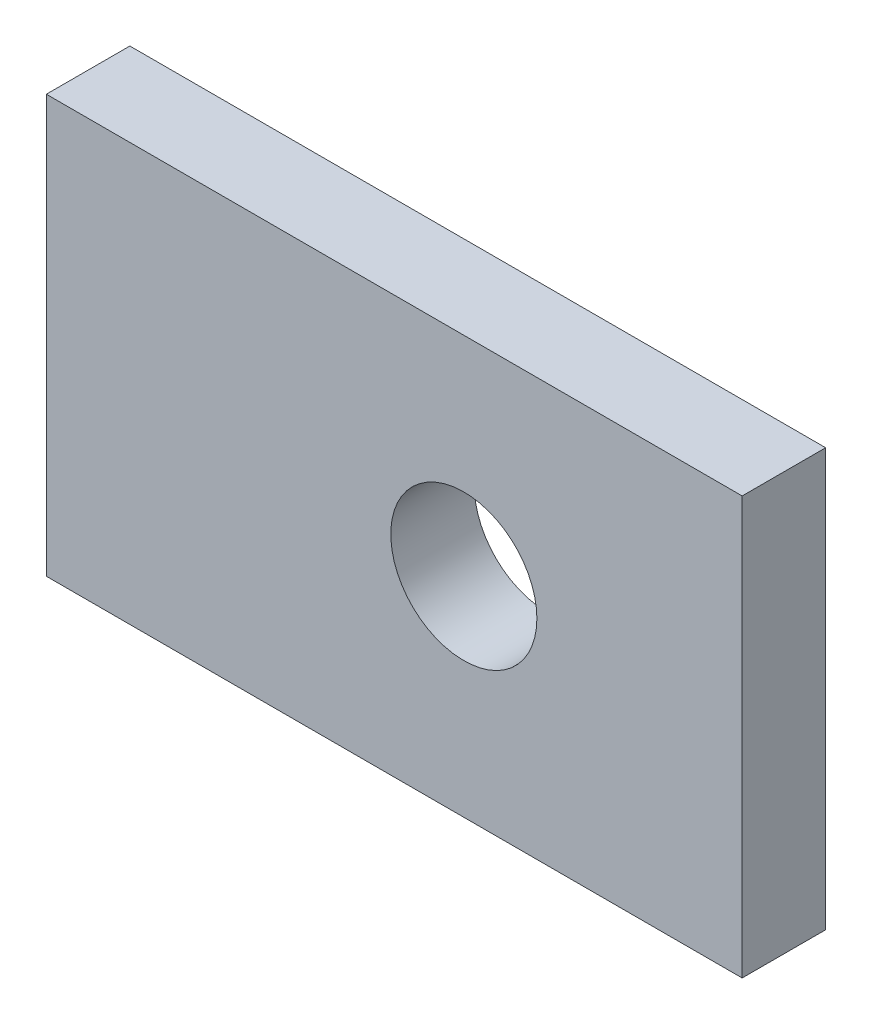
ISO-10303-21;
HEADER;
FILE_DESCRIPTION(('STEP AP214'),'2;1');
FILE_NAME('part.step','',(''),(''),'','','');
FILE_SCHEMA(('AUTOMOTIVE_DESIGN { 1 0 10303 214 1 1 1 1 }'));
ENDSEC;
DATA;
#1=APPLICATION_CONTEXT('core data for automotive mechanical design processes');
#2=APPLICATION_PROTOCOL_DEFINITION('international standard','automotive_design',2000,#1);
#3=PRODUCT_CONTEXT('',#1,'mechanical');
#4=PRODUCT('Part','Part','',(#3));
#5=PRODUCT_RELATED_PRODUCT_CATEGORY('part','',(#4));
#6=PRODUCT_DEFINITION_FORMATION('','',#4);
#7=PRODUCT_DEFINITION_CONTEXT('part definition',#1,'design');
#8=PRODUCT_DEFINITION('design','',#6,#7);
#9=PRODUCT_DEFINITION_SHAPE('','',#8);
#10=(LENGTH_UNIT() NAMED_UNIT(*) SI_UNIT(.MILLI.,.METRE.));
#11=(NAMED_UNIT(*) PLANE_ANGLE_UNIT() SI_UNIT($,.RADIAN.));
#12=(NAMED_UNIT(*) SI_UNIT($,.STERADIAN.) SOLID_ANGLE_UNIT());
#13=UNCERTAINTY_MEASURE_WITH_UNIT(LENGTH_MEASURE(1.E-05),#10,'distance_accuracy_value','');
#14=(GEOMETRIC_REPRESENTATION_CONTEXT(3) GLOBAL_UNCERTAINTY_ASSIGNED_CONTEXT((#13)) GLOBAL_UNIT_ASSIGNED_CONTEXT((#10,
#11,#12)) REPRESENTATION_CONTEXT('',''));
#15=CARTESIAN_POINT('',(0.,0.,0.));
#16=DIRECTION('',(0.,0.,1.));
#17=DIRECTION('',(1.,0.,0.));
#18=AXIS2_PLACEMENT_3D('',#15,#16,#17);
#19=CARTESIAN_POINT('',(0.,60.,12.));
#20=DIRECTION('',(0.,0.,-1.));
#21=DIRECTION('',(-1.,0.,0.));
#22=AXIS2_PLACEMENT_3D('',#19,#20,#21);
#23=PLANE('',#22);
#24=DIRECTION('',(0.,-1.,0.));
#25=VECTOR('',#24,1.);
#26=CARTESIAN_POINT('',(0.,0.,12.));
#27=LINE('',#26,#25);
#28=CARTESIAN_POINT('',(0.,60.,12.));
#29=VERTEX_POINT('',#28);
#30=CARTESIAN_POINT('',(0.,0.,12.));
#31=VERTEX_POINT('',#30);
#32=EDGE_CURVE('E165',#29,#31,#27,.T.);
#33=ORIENTED_EDGE('',*,*,#32,.T.);
#34=DIRECTION('',(1.,0.,0.));
#35=VECTOR('',#34,1.);
#36=CARTESIAN_POINT('',(0.,0.,12.));
#37=LINE('',#36,#35);
#38=CARTESIAN_POINT('',(100.,0.,12.));
#39=VERTEX_POINT('',#38);
#40=EDGE_CURVE('E163',#31,#39,#37,.T.);
#41=ORIENTED_EDGE('',*,*,#40,.T.);
#42=DIRECTION('',(0.,1.,0.));
#43=VECTOR('',#42,1.);
#44=CARTESIAN_POINT('',(100.,0.,12.));
#45=LINE('',#44,#43);
#46=CARTESIAN_POINT('',(100.,60.,12.));
#47=VERTEX_POINT('',#46);
#48=EDGE_CURVE('E161',#39,#47,#45,.T.);
#49=ORIENTED_EDGE('',*,*,#48,.T.);
#50=DIRECTION('',(-1.,0.,0.));
#51=VECTOR('',#50,1.);
#52=CARTESIAN_POINT('',(0.,60.,12.));
#53=LINE('',#52,#51);
#54=EDGE_CURVE('E159',#47,#29,#53,.T.);
#55=ORIENTED_EDGE('',*,*,#54,.T.);
#56=EDGE_LOOP('',(#33,#41,#49,#55));
#57=FACE_BOUND('',#56,.T.);
#58=CARTESIAN_POINT('',(60.,30.,12.));
#59=DIRECTION('',(0.,0.,1.));
#60=DIRECTION('',(1.,0.,0.));
#61=AXIS2_PLACEMENT_3D('',#58,#59,#60);
#62=CIRCLE('',#61,10.5);
#63=CARTESIAN_POINT('',(70.5,30.,12.));
#64=VERTEX_POINT('',#63);
#65=EDGE_CURVE('E139',#64,#64,#62,.T.);
#66=ORIENTED_EDGE('',*,*,#65,.F.);
#67=EDGE_LOOP('',(#66));
#68=FACE_BOUND('',#67,.T.);
#69=ADVANCED_FACE('F31',(#57,#68),#23,.F.);
#70=CARTESIAN_POINT('',(0.,60.,0.));
#71=DIRECTION('',(0.,0.,-1.));
#72=DIRECTION('',(-1.,0.,0.));
#73=AXIS2_PLACEMENT_3D('',#70,#71,#72);
#74=PLANE('',#73);
#75=DIRECTION('',(0.,1.,0.));
#76=VECTOR('',#75,1.);
#77=CARTESIAN_POINT('',(26.,37.5,0.));
#78=LINE('',#77,#76);
#79=CARTESIAN_POINT('',(26.,22.5,0.));
#80=VERTEX_POINT('',#79);
#81=CARTESIAN_POINT('',(26.,37.5,0.));
#82=VERTEX_POINT('',#81);
#83=EDGE_CURVE('E150',#80,#82,#78,.T.);
#84=ORIENTED_EDGE('',*,*,#83,.T.);
#85=DIRECTION('',(-1.,0.,0.));
#86=VECTOR('',#85,1.);
#87=CARTESIAN_POINT('',(20.,37.5,0.));
#88=LINE('',#87,#86);
#89=CARTESIAN_POINT('',(0.,37.5,0.));
#90=VERTEX_POINT('',#89);
#91=EDGE_CURVE('E107',#82,#90,#88,.T.);
#92=ORIENTED_EDGE('',*,*,#91,.T.);
#93=DIRECTION('',(0.,-1.,0.));
#94=VECTOR('',#93,1.);
#95=CARTESIAN_POINT('',(0.,0.,0.));
#96=LINE('',#95,#94);
#97=CARTESIAN_POINT('',(0.,60.,0.));
#98=VERTEX_POINT('',#97);
#99=EDGE_CURVE('E119',#98,#90,#96,.T.);
#100=ORIENTED_EDGE('',*,*,#99,.F.);
#101=DIRECTION('',(-1.,0.,0.));
#102=VECTOR('',#101,1.);
#103=CARTESIAN_POINT('',(0.,60.,0.));
#104=LINE('',#103,#102);
#105=CARTESIAN_POINT('',(100.,60.,0.));
#106=VERTEX_POINT('',#105);
#107=EDGE_CURVE('E168',#106,#98,#104,.T.);
#108=ORIENTED_EDGE('',*,*,#107,.F.);
#109=DIRECTION('',(0.,1.,0.));
#110=VECTOR('',#109,1.);
#111=CARTESIAN_POINT('',(100.,0.,0.));
#112=LINE('',#111,#110);
#113=CARTESIAN_POINT('',(100.,0.,0.));
#114=VERTEX_POINT('',#113);
#115=EDGE_CURVE('E169',#114,#106,#112,.T.);
#116=ORIENTED_EDGE('',*,*,#115,.F.);
#117=DIRECTION('',(1.,0.,0.));
#118=VECTOR('',#117,1.);
#119=CARTESIAN_POINT('',(0.,0.,0.));
#120=LINE('',#119,#118);
#121=CARTESIAN_POINT('',(0.,0.,0.));
#122=VERTEX_POINT('',#121);
#123=EDGE_CURVE('E143',#122,#114,#120,.T.);
#124=ORIENTED_EDGE('',*,*,#123,.F.);
#125=CARTESIAN_POINT('',(0.,22.5,0.));
#126=VERTEX_POINT('',#125);
#127=EDGE_CURVE('E123',#126,#122,#96,.T.);
#128=ORIENTED_EDGE('',*,*,#127,.F.);
#129=DIRECTION('',(-1.,0.,0.));
#130=VECTOR('',#129,1.);
#131=CARTESIAN_POINT('',(20.,22.5,0.));
#132=LINE('',#131,#130);
#133=EDGE_CURVE('E131',#80,#126,#132,.T.);
#134=ORIENTED_EDGE('',*,*,#133,.F.);
#135=EDGE_LOOP('',(#84,#92,#100,#108,#116,#124,#128,#134));
#136=FACE_BOUND('',#135,.T.);
#137=CARTESIAN_POINT('',(60.,30.,0.));
#138=DIRECTION('',(0.,0.,1.));
#139=DIRECTION('',(1.,0.,0.));
#140=AXIS2_PLACEMENT_3D('',#137,#138,#139);
#141=CIRCLE('',#140,10.5);
#142=CARTESIAN_POINT('',(70.5,30.,0.));
#143=VERTEX_POINT('',#142);
#144=EDGE_CURVE('E136',#143,#143,#141,.T.);
#145=ORIENTED_EDGE('',*,*,#144,.T.);
#146=EDGE_LOOP('',(#145));
#147=FACE_BOUND('',#146,.T.);
#148=ADVANCED_FACE('F184',(#136,#147),#74,.T.);
#149=CARTESIAN_POINT('',(0.,0.,12.));
#150=DIRECTION('',(1.,0.,0.));
#151=DIRECTION('',(0.,0.,-1.));
#152=AXIS2_PLACEMENT_3D('',#149,#150,#151);
#153=PLANE('',#152);
#154=ORIENTED_EDGE('',*,*,#99,.T.);
#155=DIRECTION('',(0.,-0.6,-0.8));
#156=VECTOR('',#155,1.);
#157=CARTESIAN_POINT('',(0.,37.5,0.));
#158=LINE('',#157,#156);
#159=CARTESIAN_POINT('',(0.,33.2,-5.7333333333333));
#160=VERTEX_POINT('',#159);
#161=EDGE_CURVE('E102',#90,#160,#158,.T.);
#162=ORIENTED_EDGE('',*,*,#161,.T.);
#163=CARTESIAN_POINT('',(0.,30.,-3.33333333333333));
#164=DIRECTION('',(-1.,0.,0.));
#165=DIRECTION('',(0.,0.,-1.));
#166=AXIS2_PLACEMENT_3D('',#163,#164,#165);
#167=CIRCLE('',#166,4.);
#168=CARTESIAN_POINT('',(0.,26.8,-5.7333333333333));
#169=VERTEX_POINT('',#168);
#170=EDGE_CURVE('E110',#160,#169,#167,.T.);
#171=ORIENTED_EDGE('',*,*,#170,.T.);
#172=DIRECTION('',(0.,-0.6,0.8));
#173=VECTOR('',#172,1.);
#174=CARTESIAN_POINT('',(0.,26.8,-5.7333333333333));
#175=LINE('',#174,#173);
#176=EDGE_CURVE('E114',#169,#126,#175,.T.);
#177=ORIENTED_EDGE('',*,*,#176,.T.);
#178=ORIENTED_EDGE('',*,*,#127,.T.);
#179=DIRECTION('',(0.,0.,-1.));
#180=VECTOR('',#179,1.);
#181=CARTESIAN_POINT('',(0.,0.,12.));
#182=LINE('',#181,#180);
#183=EDGE_CURVE('E147',#31,#122,#182,.T.);
#184=ORIENTED_EDGE('',*,*,#183,.F.);
#185=ORIENTED_EDGE('',*,*,#32,.F.);
#186=DIRECTION('',(0.,0.,-1.));
#187=VECTOR('',#186,1.);
#188=CARTESIAN_POINT('',(0.,60.,12.));
#189=LINE('',#188,#187);
#190=EDGE_CURVE('E157',#29,#98,#189,.T.);
#191=ORIENTED_EDGE('',*,*,#190,.T.);
#192=EDGE_LOOP('',(#154,#162,#171,#177,#178,#184,#185,#191));
#193=FACE_BOUND('',#192,.T.);
#194=ADVANCED_FACE('F33',(#193),#153,.F.);
#195=CARTESIAN_POINT('',(0.,0.,12.));
#196=DIRECTION('',(0.,1.,0.));
#197=DIRECTION('',(0.,0.,1.));
#198=AXIS2_PLACEMENT_3D('',#195,#196,#197);
#199=PLANE('',#198);
#200=ORIENTED_EDGE('',*,*,#123,.T.);
#201=DIRECTION('',(0.,0.,-1.));
#202=VECTOR('',#201,1.);
#203=CARTESIAN_POINT('',(100.,0.,12.));
#204=LINE('',#203,#202);
#205=EDGE_CURVE('E151',#39,#114,#204,.T.);
#206=ORIENTED_EDGE('',*,*,#205,.F.);
#207=ORIENTED_EDGE('',*,*,#40,.F.);
#208=ORIENTED_EDGE('',*,*,#183,.T.);
#209=EDGE_LOOP('',(#200,#206,#207,#208));
#210=FACE_BOUND('',#209,.T.);
#211=ADVANCED_FACE('F176',(#210),#199,.F.);
#212=CARTESIAN_POINT('',(100.,0.,12.));
#213=DIRECTION('',(-1.,0.,0.));
#214=DIRECTION('',(0.,0.,1.));
#215=AXIS2_PLACEMENT_3D('',#212,#213,#214);
#216=PLANE('',#215);
#217=ORIENTED_EDGE('',*,*,#115,.T.);
#218=DIRECTION('',(0.,0.,-1.));
#219=VECTOR('',#218,1.);
#220=CARTESIAN_POINT('',(100.,60.,12.));
#221=LINE('',#220,#219);
#222=EDGE_CURVE('E154',#47,#106,#221,.T.);
#223=ORIENTED_EDGE('',*,*,#222,.F.);
#224=ORIENTED_EDGE('',*,*,#48,.F.);
#225=ORIENTED_EDGE('',*,*,#205,.T.);
#226=EDGE_LOOP('',(#217,#223,#224,#225));
#227=FACE_BOUND('',#226,.T.);
#228=ADVANCED_FACE('F181',(#227),#216,.F.);
#229=CARTESIAN_POINT('',(0.,60.,12.));
#230=DIRECTION('',(0.,-1.,0.));
#231=DIRECTION('',(0.,0.,-1.));
#232=AXIS2_PLACEMENT_3D('',#229,#230,#231);
#233=PLANE('',#232);
#234=ORIENTED_EDGE('',*,*,#107,.T.);
#235=ORIENTED_EDGE('',*,*,#190,.F.);
#236=ORIENTED_EDGE('',*,*,#54,.F.);
#237=ORIENTED_EDGE('',*,*,#222,.T.);
#238=EDGE_LOOP('',(#234,#235,#236,#237));
#239=FACE_BOUND('',#238,.T.);
#240=ADVANCED_FACE('F188',(#239),#233,.F.);
#241=CARTESIAN_POINT('',(60.,30.,12.));
#242=DIRECTION('',(0.,0.,-1.));
#243=DIRECTION('',(-1.,0.,0.));
#244=AXIS2_PLACEMENT_3D('',#241,#242,#243);
#245=CYLINDRICAL_SURFACE('',#244,10.5);
#246=ORIENTED_EDGE('',*,*,#65,.T.);
#247=EDGE_LOOP('',(#246));
#248=FACE_BOUND('',#247,.T.);
#249=ORIENTED_EDGE('',*,*,#144,.F.);
#250=EDGE_LOOP('',(#249));
#251=FACE_BOUND('',#250,.T.);
#252=ADVANCED_FACE('F197',(#248,#251),#245,.F.);
#253=CARTESIAN_POINT('',(20.,26.8,-5.7333333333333));
#254=DIRECTION('',(0.,-0.8,-0.6));
#255=DIRECTION('',(0.,0.6,-0.8));
#256=AXIS2_PLACEMENT_3D('',#253,#254,#255);
#257=PLANE('',#256);
#258=ORIENTED_EDGE('',*,*,#176,.F.);
#259=DIRECTION('',(-1.,0.,0.));
#260=VECTOR('',#259,1.);
#261=CARTESIAN_POINT('',(20.,26.8,-5.7333333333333));
#262=LINE('',#261,#260);
#263=CARTESIAN_POINT('',(20.2666666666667,26.8,-5.7333333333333));
#264=VERTEX_POINT('',#263);
#265=EDGE_CURVE('E45',#264,#169,#262,.T.);
#266=ORIENTED_EDGE('',*,*,#265,.F.);
#267=DIRECTION('',(-0.624695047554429,0.468521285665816,-0.624695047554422));
#268=VECTOR('',#267,1.);
#269=CARTESIAN_POINT('',(15.0243902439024,30.7317073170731,-10.9756097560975));
#270=LINE('',#269,#268);
#271=EDGE_CURVE('E11',#264,#80,#270,.F.);
#272=ORIENTED_EDGE('',*,*,#271,.T.);
#273=ORIENTED_EDGE('',*,*,#133,.T.);
#274=EDGE_LOOP('',(#258,#266,#272,#273));
#275=FACE_BOUND('',#274,.T.);
#276=ADVANCED_FACE('F200',(#275),#257,.T.);
#277=CARTESIAN_POINT('',(20.,30.,-3.33333333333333));
#278=DIRECTION('',(-1.,0.,0.));
#279=DIRECTION('',(0.,0.,1.));
#280=AXIS2_PLACEMENT_3D('',#277,#278,#279);
#281=CYLINDRICAL_SURFACE('',#280,4.);
#282=ORIENTED_EDGE('',*,*,#170,.F.);
#283=DIRECTION('',(-1.,0.,0.));
#284=VECTOR('',#283,1.);
#285=CARTESIAN_POINT('',(20.,33.2,-5.7333333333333));
#286=LINE('',#285,#284);
#287=CARTESIAN_POINT('',(20.2666666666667,33.2,-5.7333333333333));
#288=VERTEX_POINT('',#287);
#289=EDGE_CURVE('E53',#288,#160,#286,.T.);
#290=ORIENTED_EDGE('',*,*,#289,.F.);
#291=CARTESIAN_POINT('',(22.6666666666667,30.,-3.33333333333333));
#292=DIRECTION('',(0.707106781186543,0.,-0.707106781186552));
#293=DIRECTION('',(-0.707106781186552,0.,-0.707106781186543));
#294=AXIS2_PLACEMENT_3D('',#291,#292,#293);
#295=ELLIPSE('',#294,5.65685424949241,4.);
#296=CARTESIAN_POINT('',(20.,32.9814239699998,-5.99999999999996));
#297=VERTEX_POINT('',#296);
#298=EDGE_CURVE('E306',#288,#297,#295,.F.);
#299=ORIENTED_EDGE('',*,*,#298,.T.);
#300=CARTESIAN_POINT('',(20.,30.,-3.33333333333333));
#301=DIRECTION('',(-1.,0.,0.));
#302=DIRECTION('',(0.,0.,-1.));
#303=AXIS2_PLACEMENT_3D('',#300,#301,#302);
#304=CIRCLE('',#303,4.);
#305=CARTESIAN_POINT('',(20.,27.0185760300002,-5.99999999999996));
#306=VERTEX_POINT('',#305);
#307=EDGE_CURVE('E130',#297,#306,#304,.T.);
#308=ORIENTED_EDGE('',*,*,#307,.T.);
#309=CARTESIAN_POINT('',(22.6666666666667,30.,-3.33333333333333));
#310=DIRECTION('',(0.707106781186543,0.,-0.707106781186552));
#311=DIRECTION('',(-0.707106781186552,0.,-0.707106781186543));
#312=AXIS2_PLACEMENT_3D('',#309,#310,#311);
#313=ELLIPSE('',#312,5.65685424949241,4.);
#314=EDGE_CURVE('E39',#306,#264,#313,.F.);
#315=ORIENTED_EDGE('',*,*,#314,.T.);
#316=ORIENTED_EDGE('',*,*,#265,.T.);
#317=EDGE_LOOP('',(#282,#290,#299,#308,#315,#316));
#318=FACE_BOUND('',#317,.T.);
#319=ADVANCED_FACE('F111',(#318),#281,.T.);
#320=CARTESIAN_POINT('',(20.,37.5,0.));
#321=DIRECTION('',(0.,0.8,-0.6));
#322=DIRECTION('',(0.,0.6,0.8));
#323=AXIS2_PLACEMENT_3D('',#320,#321,#322);
#324=PLANE('',#323);
#325=ORIENTED_EDGE('',*,*,#161,.F.);
#326=ORIENTED_EDGE('',*,*,#91,.F.);
#327=DIRECTION('',(0.624695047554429,0.468521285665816,0.624695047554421));
#328=VECTOR('',#327,1.);
#329=CARTESIAN_POINT('',(32.5853658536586,42.4390243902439,6.58536585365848));
#330=LINE('',#329,#328);
#331=EDGE_CURVE('E105',#82,#288,#330,.F.);
#332=ORIENTED_EDGE('',*,*,#331,.T.);
#333=ORIENTED_EDGE('',*,*,#289,.T.);
#334=EDGE_LOOP('',(#325,#326,#332,#333));
#335=FACE_BOUND('',#334,.T.);
#336=ADVANCED_FACE('F100',(#335),#324,.T.);
#337=CARTESIAN_POINT('',(20.,30.,-3.33333333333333));
#338=DIRECTION('',(1.,0.,0.));
#339=DIRECTION('',(0.,0.,-1.));
#340=AXIS2_PLACEMENT_3D('',#337,#338,#339);
#341=PLANE('',#340);
#342=ORIENTED_EDGE('',*,*,#307,.F.);
#343=DIRECTION('',(0.,-1.,0.));
#344=VECTOR('',#343,1.);
#345=CARTESIAN_POINT('',(20.,22.5,-5.99999999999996));
#346=LINE('',#345,#344);
#347=EDGE_CURVE('E303',#297,#306,#346,.T.);
#348=ORIENTED_EDGE('',*,*,#347,.T.);
#349=EDGE_LOOP('',(#342,#348));
#350=FACE_BOUND('',#349,.T.);
#351=ADVANCED_FACE('F249',(#350),#341,.T.);
#352=CARTESIAN_POINT('',(26.,60.,0.));
#353=DIRECTION('',(0.707106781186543,0.,-0.707106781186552));
#354=DIRECTION('',(-0.707106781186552,0.,-0.707106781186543));
#355=AXIS2_PLACEMENT_3D('',#352,#353,#354);
#356=PLANE('',#355);
#357=ORIENTED_EDGE('',*,*,#314,.F.);
#358=ORIENTED_EDGE('',*,*,#347,.F.);
#359=ORIENTED_EDGE('',*,*,#298,.F.);
#360=ORIENTED_EDGE('',*,*,#331,.F.);
#361=ORIENTED_EDGE('',*,*,#83,.F.);
#362=ORIENTED_EDGE('',*,*,#271,.F.);
#363=EDGE_LOOP('',(#357,#358,#359,#360,#361,#362));
#364=FACE_BOUND('',#363,.T.);
#365=ADVANCED_FACE('F255',(#364),#356,.T.);
#366=CLOSED_SHELL('',(#69,#148,#194,#211,#228,#240,#252,#276,#319,#336,#351,#365));
#367=MANIFOLD_SOLID_BREP('B2',#366);
#368=ADVANCED_BREP_SHAPE_REPRESENTATION('',(#18,#367),#14);
#369=SHAPE_DEFINITION_REPRESENTATION(#9,#368);
ENDSEC;
END-ISO-10303-21;
